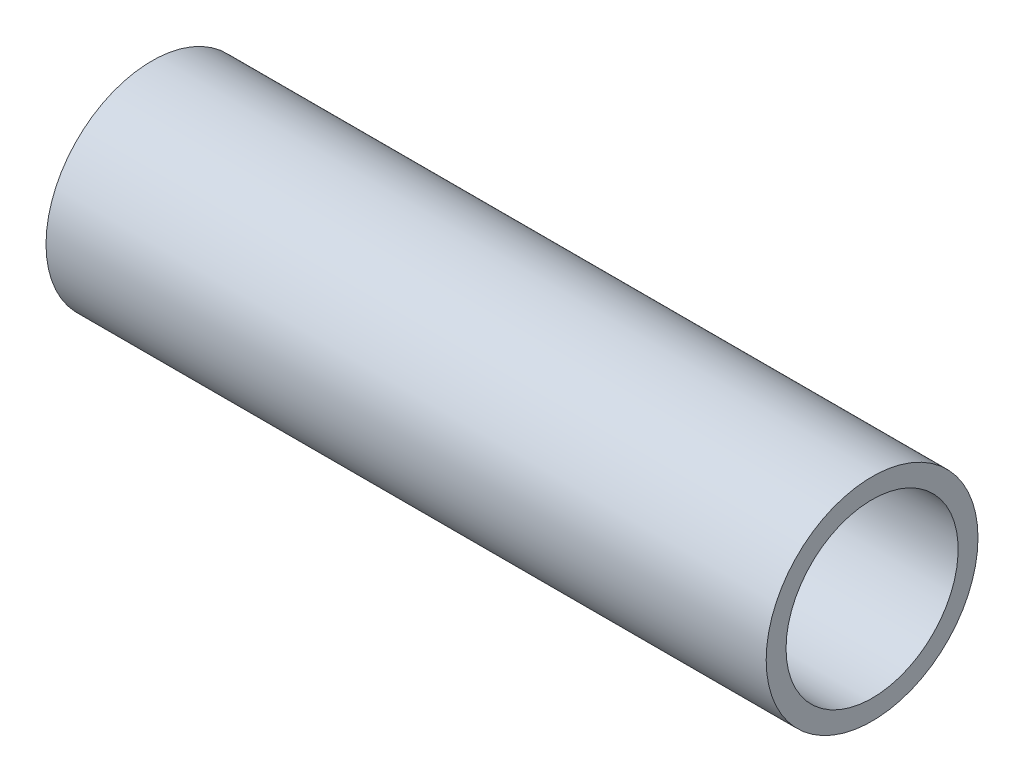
ISO-10303-21;
HEADER;
FILE_DESCRIPTION(('STEP AP214'),'2;1');
FILE_NAME('part.step','',(''),(''),'','','');
FILE_SCHEMA(('AUTOMOTIVE_DESIGN { 1 0 10303 214 1 1 1 1 }'));
ENDSEC;
DATA;
#1=APPLICATION_CONTEXT('core data for automotive mechanical design processes');
#2=APPLICATION_PROTOCOL_DEFINITION('international standard','automotive_design',2000,#1);
#3=PRODUCT_CONTEXT('',#1,'mechanical');
#4=PRODUCT('Part','Part','',(#3));
#5=PRODUCT_RELATED_PRODUCT_CATEGORY('part','',(#4));
#6=PRODUCT_DEFINITION_FORMATION('','',#4);
#7=PRODUCT_DEFINITION_CONTEXT('part definition',#1,'design');
#8=PRODUCT_DEFINITION('design','',#6,#7);
#9=PRODUCT_DEFINITION_SHAPE('','',#8);
#10=(LENGTH_UNIT() NAMED_UNIT(*) SI_UNIT(.MILLI.,.METRE.));
#11=(NAMED_UNIT(*) PLANE_ANGLE_UNIT() SI_UNIT($,.RADIAN.));
#12=(NAMED_UNIT(*) SI_UNIT($,.STERADIAN.) SOLID_ANGLE_UNIT());
#13=UNCERTAINTY_MEASURE_WITH_UNIT(LENGTH_MEASURE(1.E-05),#10,'distance_accuracy_value','');
#14=(GEOMETRIC_REPRESENTATION_CONTEXT(3) GLOBAL_UNCERTAINTY_ASSIGNED_CONTEXT((#13)) GLOBAL_UNIT_ASSIGNED_CONTEXT((#10,
#11,#12)) REPRESENTATION_CONTEXT('',''));
#15=CARTESIAN_POINT('',(0.,0.,0.));
#16=DIRECTION('',(0.,0.,1.));
#17=DIRECTION('',(1.,0.,0.));
#18=AXIS2_PLACEMENT_3D('',#15,#16,#17);
#19=CARTESIAN_POINT('',(102.,-154.573977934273,0.));
#20=DIRECTION('',(1.,0.,0.));
#21=DIRECTION('',(0.,0.,-1.));
#22=AXIS2_PLACEMENT_3D('',#19,#20,#21);
#23=PLANE('',#22);
#24=CARTESIAN_POINT('',(102.,-170.823977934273,0.));
#25=DIRECTION('',(-1.,0.,0.));
#26=DIRECTION('',(0.,0.,1.));
#27=AXIS2_PLACEMENT_3D('',#24,#25,#26);
#28=CIRCLE('',#27,16.25);
#29=CARTESIAN_POINT('',(102.,-170.823977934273,16.25));
#30=VERTEX_POINT('',#29);
#31=EDGE_CURVE('E44',#30,#30,#28,.T.);
#32=ORIENTED_EDGE('',*,*,#31,.F.);
#33=EDGE_LOOP('',(#32));
#34=FACE_BOUND('',#33,.T.);
#35=CARTESIAN_POINT('',(102.,-170.823977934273,0.));
#36=DIRECTION('',(-1.,0.,0.));
#37=DIRECTION('',(0.,0.,1.));
#38=AXIS2_PLACEMENT_3D('',#35,#36,#37);
#39=CIRCLE('',#38,20.);
#40=CARTESIAN_POINT('',(102.,-170.823977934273,20.));
#41=VERTEX_POINT('',#40);
#42=EDGE_CURVE('E10',#41,#41,#39,.T.);
#43=ORIENTED_EDGE('',*,*,#42,.T.);
#44=EDGE_LOOP('',(#43));
#45=FACE_BOUND('',#44,.T.);
#46=ADVANCED_FACE('F30',(#34,#45),#23,.F.);
#47=CARTESIAN_POINT('',(136.334753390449,-170.823977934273,0.));
#48=DIRECTION('',(-1.,0.,0.));
#49=DIRECTION('',(0.,0.,1.));
#50=AXIS2_PLACEMENT_3D('',#47,#48,#49);
#51=CYLINDRICAL_SURFACE('',#50,20.);
#52=ORIENTED_EDGE('',*,*,#42,.F.);
#53=EDGE_LOOP('',(#52));
#54=FACE_BOUND('',#53,.T.);
#55=CARTESIAN_POINT('',(238.,-170.823977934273,0.));
#56=DIRECTION('',(-1.,0.,0.));
#57=DIRECTION('',(0.,0.,1.));
#58=AXIS2_PLACEMENT_3D('',#55,#56,#57);
#59=CIRCLE('',#58,20.);
#60=CARTESIAN_POINT('',(238.,-170.823977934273,20.));
#61=VERTEX_POINT('',#60);
#62=EDGE_CURVE('E36',#61,#61,#59,.T.);
#63=ORIENTED_EDGE('',*,*,#62,.T.);
#64=EDGE_LOOP('',(#63));
#65=FACE_BOUND('',#64,.T.);
#66=ADVANCED_FACE('F53',(#54,#65),#51,.T.);
#67=CARTESIAN_POINT('',(238.,-154.573977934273,0.));
#68=DIRECTION('',(-1.,0.,0.));
#69=DIRECTION('',(0.,0.,1.));
#70=AXIS2_PLACEMENT_3D('',#67,#68,#69);
#71=PLANE('',#70);
#72=ORIENTED_EDGE('',*,*,#62,.F.);
#73=EDGE_LOOP('',(#72));
#74=FACE_BOUND('',#73,.T.);
#75=CARTESIAN_POINT('',(238.,-170.823977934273,0.));
#76=DIRECTION('',(-1.,0.,0.));
#77=DIRECTION('',(0.,0.,1.));
#78=AXIS2_PLACEMENT_3D('',#75,#76,#77);
#79=CIRCLE('',#78,16.25);
#80=CARTESIAN_POINT('',(238.,-170.823977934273,16.25));
#81=VERTEX_POINT('',#80);
#82=EDGE_CURVE('E40',#81,#81,#79,.T.);
#83=ORIENTED_EDGE('',*,*,#82,.T.);
#84=EDGE_LOOP('',(#83));
#85=FACE_BOUND('',#84,.T.);
#86=ADVANCED_FACE('F57',(#74,#85),#71,.F.);
#87=CARTESIAN_POINT('',(136.334753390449,-170.823977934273,0.));
#88=DIRECTION('',(-1.,0.,0.));
#89=DIRECTION('',(0.,0.,1.));
#90=AXIS2_PLACEMENT_3D('',#87,#88,#89);
#91=CYLINDRICAL_SURFACE('',#90,16.25);
#92=ORIENTED_EDGE('',*,*,#82,.F.);
#93=EDGE_LOOP('',(#92));
#94=FACE_BOUND('',#93,.T.);
#95=ORIENTED_EDGE('',*,*,#31,.T.);
#96=EDGE_LOOP('',(#95));
#97=FACE_BOUND('',#96,.T.);
#98=ADVANCED_FACE('F50',(#94,#97),#91,.F.);
#99=CLOSED_SHELL('',(#46,#66,#86,#98));
#100=MANIFOLD_SOLID_BREP('B2',#99);
#101=ADVANCED_BREP_SHAPE_REPRESENTATION('',(#18,#100),#14);
#102=SHAPE_DEFINITION_REPRESENTATION(#9,#101);
ENDSEC;
END-ISO-10303-21;
